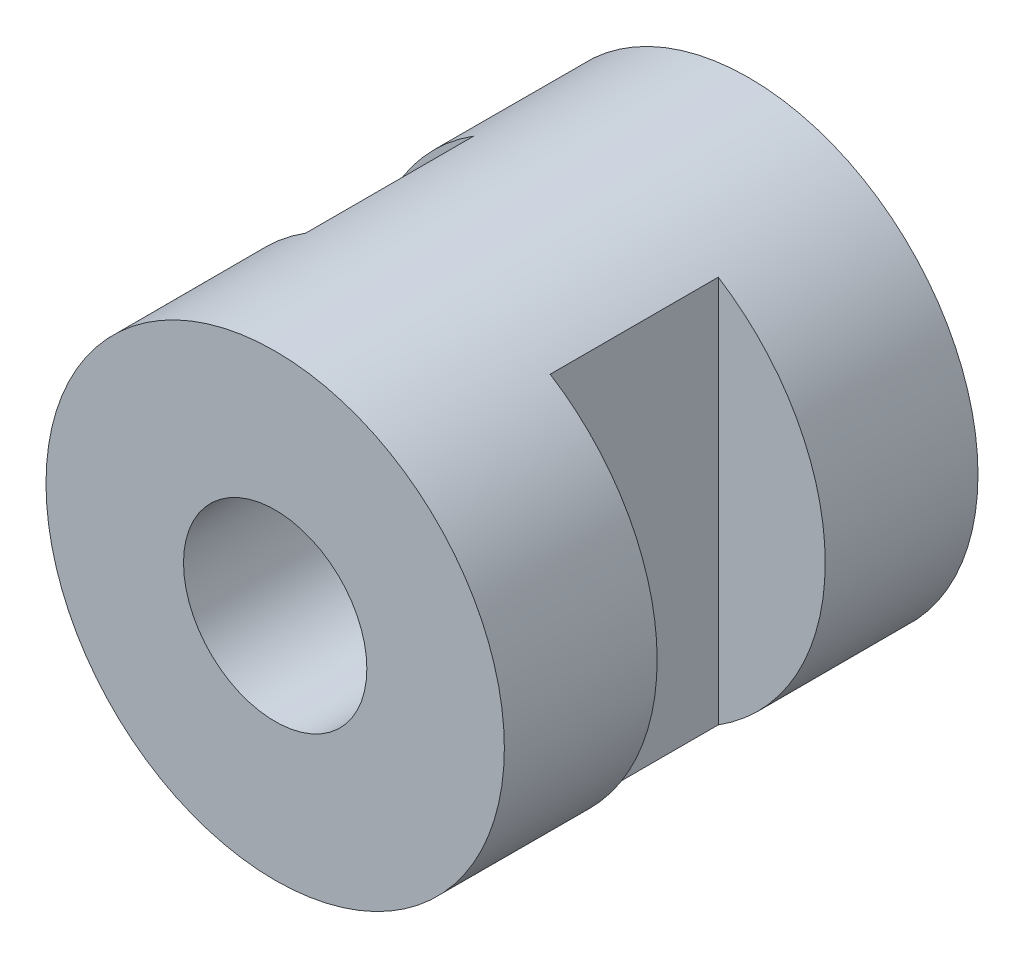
ISO-10303-21;
HEADER;
FILE_DESCRIPTION(('STEP AP214'),'2;1');
FILE_NAME('part.step','',(''),(''),'','','');
FILE_SCHEMA(('AUTOMOTIVE_DESIGN { 1 0 10303 214 1 1 1 1 }'));
ENDSEC;
DATA;
#1=APPLICATION_CONTEXT('core data for automotive mechanical design processes');
#2=APPLICATION_PROTOCOL_DEFINITION('international standard','automotive_design',2000,#1);
#3=PRODUCT_CONTEXT('',#1,'mechanical');
#4=PRODUCT('Part','Part','',(#3));
#5=PRODUCT_RELATED_PRODUCT_CATEGORY('part','',(#4));
#6=PRODUCT_DEFINITION_FORMATION('','',#4);
#7=PRODUCT_DEFINITION_CONTEXT('part definition',#1,'design');
#8=PRODUCT_DEFINITION('design','',#6,#7);
#9=PRODUCT_DEFINITION_SHAPE('','',#8);
#10=(LENGTH_UNIT() NAMED_UNIT(*) SI_UNIT(.MILLI.,.METRE.));
#11=(NAMED_UNIT(*) PLANE_ANGLE_UNIT() SI_UNIT($,.RADIAN.));
#12=(NAMED_UNIT(*) SI_UNIT($,.STERADIAN.) SOLID_ANGLE_UNIT());
#13=UNCERTAINTY_MEASURE_WITH_UNIT(LENGTH_MEASURE(1.E-05),#10,'distance_accuracy_value','');
#14=(GEOMETRIC_REPRESENTATION_CONTEXT(3) GLOBAL_UNCERTAINTY_ASSIGNED_CONTEXT((#13)) GLOBAL_UNIT_ASSIGNED_CONTEXT((#10,
#11,#12)) REPRESENTATION_CONTEXT('',''));
#15=CARTESIAN_POINT('',(0.,0.,0.));
#16=DIRECTION('',(0.,0.,1.));
#17=DIRECTION('',(1.,0.,0.));
#18=AXIS2_PLACEMENT_3D('',#15,#16,#17);
#19=CARTESIAN_POINT('',(0.,0.,15.5));
#20=DIRECTION('',(0.,0.,-1.));
#21=DIRECTION('',(-1.,0.,0.));
#22=AXIS2_PLACEMENT_3D('',#19,#20,#21);
#23=CYLINDRICAL_SURFACE('',#22,7.5);
#24=DIRECTION('',(0.,0.,-1.));
#25=VECTOR('',#24,1.);
#26=CARTESIAN_POINT('',(-4.,-6.34428877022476,15.5));
#27=LINE('',#26,#25);
#28=CARTESIAN_POINT('',(-4.,-6.34428877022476,10.5));
#29=VERTEX_POINT('',#28);
#30=CARTESIAN_POINT('',(-4.,-6.34428877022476,5.));
#31=VERTEX_POINT('',#30);
#32=EDGE_CURVE('E39',#29,#31,#27,.T.);
#33=ORIENTED_EDGE('',*,*,#32,.T.);
#34=CARTESIAN_POINT('',(0.,0.,5.));
#35=DIRECTION('',(0.,0.,-1.));
#36=DIRECTION('',(-1.,0.,0.));
#37=AXIS2_PLACEMENT_3D('',#34,#35,#36);
#38=CIRCLE('',#37,7.5);
#39=CARTESIAN_POINT('',(-4.,6.34428877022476,5.));
#40=VERTEX_POINT('',#39);
#41=EDGE_CURVE('E11',#31,#40,#38,.T.);
#42=ORIENTED_EDGE('',*,*,#41,.T.);
#43=DIRECTION('',(0.,0.,-1.));
#44=VECTOR('',#43,1.);
#45=CARTESIAN_POINT('',(-4.,6.34428877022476,15.5));
#46=LINE('',#45,#44);
#47=CARTESIAN_POINT('',(-4.,6.34428877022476,10.5));
#48=VERTEX_POINT('',#47);
#49=EDGE_CURVE('E75',#40,#48,#46,.F.);
#50=ORIENTED_EDGE('',*,*,#49,.T.);
#51=CARTESIAN_POINT('',(0.,0.,10.5));
#52=DIRECTION('',(0.,0.,1.));
#53=DIRECTION('',(1.,0.,0.));
#54=AXIS2_PLACEMENT_3D('',#51,#52,#53);
#55=CIRCLE('',#54,7.5);
#56=EDGE_CURVE('E70',#48,#29,#55,.T.);
#57=ORIENTED_EDGE('',*,*,#56,.T.);
#58=EDGE_LOOP('',(#33,#42,#50,#57));
#59=FACE_BOUND('',#58,.T.);
#60=DIRECTION('',(0.,0.,-1.));
#61=VECTOR('',#60,1.);
#62=CARTESIAN_POINT('',(4.,-6.34428877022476,15.5));
#63=LINE('',#62,#61);
#64=CARTESIAN_POINT('',(4.,-6.34428877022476,5.));
#65=VERTEX_POINT('',#64);
#66=CARTESIAN_POINT('',(4.,-6.34428877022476,10.5));
#67=VERTEX_POINT('',#66);
#68=EDGE_CURVE('E93',#65,#67,#63,.F.);
#69=ORIENTED_EDGE('',*,*,#68,.T.);
#70=CARTESIAN_POINT('',(0.,0.,10.5));
#71=DIRECTION('',(0.,0.,1.));
#72=DIRECTION('',(1.,0.,0.));
#73=AXIS2_PLACEMENT_3D('',#70,#71,#72);
#74=CIRCLE('',#73,7.5);
#75=CARTESIAN_POINT('',(4.,6.34428877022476,10.5));
#76=VERTEX_POINT('',#75);
#77=EDGE_CURVE('E76',#67,#76,#74,.T.);
#78=ORIENTED_EDGE('',*,*,#77,.T.);
#79=DIRECTION('',(0.,0.,-1.));
#80=VECTOR('',#79,1.);
#81=CARTESIAN_POINT('',(4.,6.34428877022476,15.5));
#82=LINE('',#81,#80);
#83=CARTESIAN_POINT('',(4.,6.34428877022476,5.));
#84=VERTEX_POINT('',#83);
#85=EDGE_CURVE('E90',#76,#84,#82,.T.);
#86=ORIENTED_EDGE('',*,*,#85,.T.);
#87=CARTESIAN_POINT('',(0.,0.,5.));
#88=DIRECTION('',(0.,0.,-1.));
#89=DIRECTION('',(-1.,0.,0.));
#90=AXIS2_PLACEMENT_3D('',#87,#88,#89);
#91=CIRCLE('',#90,7.5);
#92=EDGE_CURVE('E96',#84,#65,#91,.T.);
#93=ORIENTED_EDGE('',*,*,#92,.T.);
#94=EDGE_LOOP('',(#69,#78,#86,#93));
#95=FACE_BOUND('',#94,.T.);
#96=CARTESIAN_POINT('',(0.,0.,15.5));
#97=DIRECTION('',(0.,0.,1.));
#98=DIRECTION('',(1.,0.,0.));
#99=AXIS2_PLACEMENT_3D('',#96,#97,#98);
#100=CIRCLE('',#99,7.5);
#101=CARTESIAN_POINT('',(7.5,0.,15.5));
#102=VERTEX_POINT('',#101);
#103=EDGE_CURVE('E99',#102,#102,#100,.T.);
#104=ORIENTED_EDGE('',*,*,#103,.F.);
#105=EDGE_LOOP('',(#104));
#106=FACE_BOUND('',#105,.T.);
#107=CARTESIAN_POINT('',(0.,0.,0.));
#108=DIRECTION('',(0.,0.,1.));
#109=DIRECTION('',(1.,0.,0.));
#110=AXIS2_PLACEMENT_3D('',#107,#108,#109);
#111=CIRCLE('',#110,7.5);
#112=CARTESIAN_POINT('',(7.5,0.,0.));
#113=VERTEX_POINT('',#112);
#114=EDGE_CURVE('E100',#113,#113,#111,.T.);
#115=ORIENTED_EDGE('',*,*,#114,.T.);
#116=EDGE_LOOP('',(#115));
#117=FACE_BOUND('',#116,.T.);
#118=ADVANCED_FACE('F32',(#59,#95,#106,#117),#23,.T.);
#119=CARTESIAN_POINT('',(0.,0.,15.5));
#120=DIRECTION('',(0.,0.,1.));
#121=DIRECTION('',(1.,0.,0.));
#122=AXIS2_PLACEMENT_3D('',#119,#120,#121);
#123=PLANE('',#122);
#124=CARTESIAN_POINT('',(0.,0.,15.5));
#125=DIRECTION('',(0.,0.,-1.));
#126=DIRECTION('',(-1.,0.,0.));
#127=AXIS2_PLACEMENT_3D('',#124,#125,#126);
#128=CIRCLE('',#127,3.);
#129=CARTESIAN_POINT('',(-3.,0.,15.5));
#130=VERTEX_POINT('',#129);
#131=EDGE_CURVE('E83',#130,#130,#128,.T.);
#132=ORIENTED_EDGE('',*,*,#131,.T.);
#133=EDGE_LOOP('',(#132));
#134=FACE_BOUND('',#133,.T.);
#135=ORIENTED_EDGE('',*,*,#103,.T.);
#136=EDGE_LOOP('',(#135));
#137=FACE_BOUND('',#136,.T.);
#138=ADVANCED_FACE('F116',(#134,#137),#123,.T.);
#139=CARTESIAN_POINT('',(0.,0.,0.));
#140=DIRECTION('',(0.,0.,1.));
#141=DIRECTION('',(1.,0.,0.));
#142=AXIS2_PLACEMENT_3D('',#139,#140,#141);
#143=PLANE('',#142);
#144=CARTESIAN_POINT('',(0.,0.,0.));
#145=DIRECTION('',(0.,0.,-1.));
#146=DIRECTION('',(-1.,0.,0.));
#147=AXIS2_PLACEMENT_3D('',#144,#145,#146);
#148=CIRCLE('',#147,3.);
#149=CARTESIAN_POINT('',(-3.,0.,0.));
#150=VERTEX_POINT('',#149);
#151=EDGE_CURVE('E110',#150,#150,#148,.T.);
#152=ORIENTED_EDGE('',*,*,#151,.F.);
#153=EDGE_LOOP('',(#152));
#154=FACE_BOUND('',#153,.T.);
#155=ORIENTED_EDGE('',*,*,#114,.F.);
#156=EDGE_LOOP('',(#155));
#157=FACE_BOUND('',#156,.T.);
#158=ADVANCED_FACE('F125',(#154,#157),#143,.F.);
#159=CARTESIAN_POINT('',(8.75338902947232,-7.5,10.5));
#160=DIRECTION('',(0.,0.,1.));
#161=DIRECTION('',(1.,0.,0.));
#162=AXIS2_PLACEMENT_3D('',#159,#160,#161);
#163=PLANE('',#162);
#164=DIRECTION('',(0.,1.,0.));
#165=VECTOR('',#164,1.);
#166=CARTESIAN_POINT('',(4.,-7.5,10.5));
#167=LINE('',#166,#165);
#168=EDGE_CURVE('E103',#67,#76,#167,.T.);
#169=ORIENTED_EDGE('',*,*,#168,.T.);
#170=ORIENTED_EDGE('',*,*,#77,.F.);
#171=EDGE_LOOP('',(#169,#170));
#172=FACE_BOUND('',#171,.T.);
#173=ADVANCED_FACE('F128',(#172),#163,.F.);
#174=CARTESIAN_POINT('',(4.,-7.5,10.5));
#175=DIRECTION('',(-1.,0.,0.));
#176=DIRECTION('',(0.,0.,1.));
#177=AXIS2_PLACEMENT_3D('',#174,#175,#176);
#178=PLANE('',#177);
#179=ORIENTED_EDGE('',*,*,#168,.F.);
#180=ORIENTED_EDGE('',*,*,#68,.F.);
#181=DIRECTION('',(0.,1.,0.));
#182=VECTOR('',#181,1.);
#183=CARTESIAN_POINT('',(4.,-7.5,5.));
#184=LINE('',#183,#182);
#185=EDGE_CURVE('E52',#65,#84,#184,.T.);
#186=ORIENTED_EDGE('',*,*,#185,.T.);
#187=ORIENTED_EDGE('',*,*,#85,.F.);
#188=EDGE_LOOP('',(#179,#180,#186,#187));
#189=FACE_BOUND('',#188,.T.);
#190=ADVANCED_FACE('F143',(#189),#178,.F.);
#191=CARTESIAN_POINT('',(8.75338902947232,-7.5,5.));
#192=DIRECTION('',(0.,0.,-1.));
#193=DIRECTION('',(-1.,0.,0.));
#194=AXIS2_PLACEMENT_3D('',#191,#192,#193);
#195=PLANE('',#194);
#196=ORIENTED_EDGE('',*,*,#185,.F.);
#197=ORIENTED_EDGE('',*,*,#92,.F.);
#198=EDGE_LOOP('',(#196,#197));
#199=FACE_BOUND('',#198,.T.);
#200=ADVANCED_FACE('F139',(#199),#195,.F.);
#201=CARTESIAN_POINT('',(-8.75338902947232,-7.5,5.));
#202=DIRECTION('',(0.,0.,-1.));
#203=DIRECTION('',(-1.,0.,0.));
#204=AXIS2_PLACEMENT_3D('',#201,#202,#203);
#205=PLANE('',#204);
#206=DIRECTION('',(0.,1.,0.));
#207=VECTOR('',#206,1.);
#208=CARTESIAN_POINT('',(-4.,-7.5,5.));
#209=LINE('',#208,#207);
#210=EDGE_CURVE('E82',#31,#40,#209,.T.);
#211=ORIENTED_EDGE('',*,*,#210,.T.);
#212=ORIENTED_EDGE('',*,*,#41,.F.);
#213=EDGE_LOOP('',(#211,#212));
#214=FACE_BOUND('',#213,.T.);
#215=ADVANCED_FACE('F142',(#214),#205,.F.);
#216=CARTESIAN_POINT('',(-4.,-7.5,10.5));
#217=DIRECTION('',(1.,0.,0.));
#218=DIRECTION('',(0.,0.,-1.));
#219=AXIS2_PLACEMENT_3D('',#216,#217,#218);
#220=PLANE('',#219);
#221=DIRECTION('',(0.,1.,0.));
#222=VECTOR('',#221,1.);
#223=CARTESIAN_POINT('',(-4.,-7.5,10.5));
#224=LINE('',#223,#222);
#225=EDGE_CURVE('E45',#29,#48,#224,.T.);
#226=ORIENTED_EDGE('',*,*,#225,.T.);
#227=ORIENTED_EDGE('',*,*,#49,.F.);
#228=ORIENTED_EDGE('',*,*,#210,.F.);
#229=ORIENTED_EDGE('',*,*,#32,.F.);
#230=EDGE_LOOP('',(#226,#227,#228,#229));
#231=FACE_BOUND('',#230,.T.);
#232=ADVANCED_FACE('F79',(#231),#220,.F.);
#233=CARTESIAN_POINT('',(-8.75338902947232,-7.5,10.5));
#234=DIRECTION('',(0.,0.,1.));
#235=DIRECTION('',(1.,0.,0.));
#236=AXIS2_PLACEMENT_3D('',#233,#234,#235);
#237=PLANE('',#236);
#238=ORIENTED_EDGE('',*,*,#225,.F.);
#239=ORIENTED_EDGE('',*,*,#56,.F.);
#240=EDGE_LOOP('',(#238,#239));
#241=FACE_BOUND('',#240,.T.);
#242=ADVANCED_FACE('F71',(#241),#237,.F.);
#243=CARTESIAN_POINT('',(0.,0.,15.5));
#244=DIRECTION('',(0.,0.,-1.));
#245=DIRECTION('',(-1.,0.,0.));
#246=AXIS2_PLACEMENT_3D('',#243,#244,#245);
#247=CYLINDRICAL_SURFACE('',#246,3.);
#248=ORIENTED_EDGE('',*,*,#131,.F.);
#249=EDGE_LOOP('',(#248));
#250=FACE_BOUND('',#249,.T.);
#251=ORIENTED_EDGE('',*,*,#151,.T.);
#252=EDGE_LOOP('',(#251));
#253=FACE_BOUND('',#252,.T.);
#254=ADVANCED_FACE('F119',(#250,#253),#247,.F.);
#255=CLOSED_SHELL('',(#118,#138,#158,#173,#190,#200,#215,#232,#242,#254));
#256=MANIFOLD_SOLID_BREP('B2',#255);
#257=ADVANCED_BREP_SHAPE_REPRESENTATION('',(#18,#256),#14);
#258=SHAPE_DEFINITION_REPRESENTATION(#9,#257);
ENDSEC;
END-ISO-10303-21;
